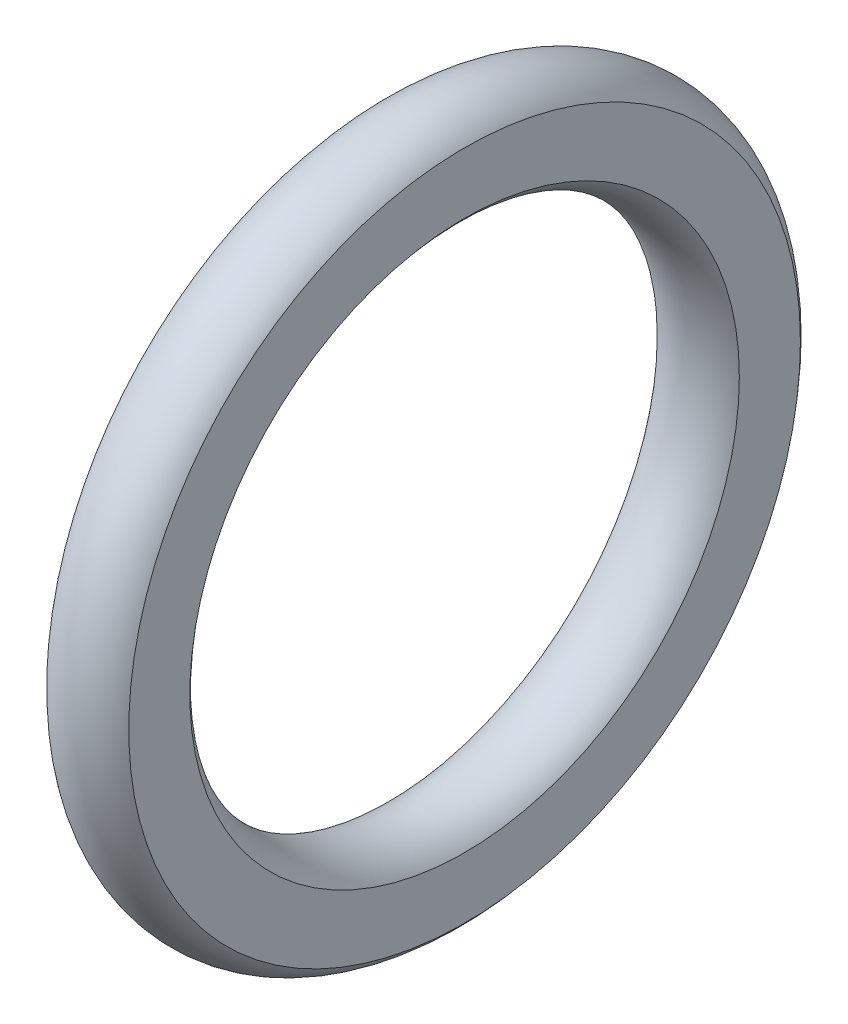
ISO-10303-21;
HEADER;
FILE_DESCRIPTION(('STEP AP214'),'2;1');
FILE_NAME('part.step','',(''),(''),'','','');
FILE_SCHEMA(('AUTOMOTIVE_DESIGN { 1 0 10303 214 1 1 1 1 }'));
ENDSEC;
DATA;
#1=APPLICATION_CONTEXT('core data for automotive mechanical design processes');
#2=APPLICATION_PROTOCOL_DEFINITION('international standard','automotive_design',2000,#1);
#3=PRODUCT_CONTEXT('',#1,'mechanical');
#4=PRODUCT('Part','Part','',(#3));
#5=PRODUCT_RELATED_PRODUCT_CATEGORY('part','',(#4));
#6=PRODUCT_DEFINITION_FORMATION('','',#4);
#7=PRODUCT_DEFINITION_CONTEXT('part definition',#1,'design');
#8=PRODUCT_DEFINITION('design','',#6,#7);
#9=PRODUCT_DEFINITION_SHAPE('','',#8);
#10=(LENGTH_UNIT() NAMED_UNIT(*) SI_UNIT(.MILLI.,.METRE.));
#11=(NAMED_UNIT(*) PLANE_ANGLE_UNIT() SI_UNIT($,.RADIAN.));
#12=(NAMED_UNIT(*) SI_UNIT($,.STERADIAN.) SOLID_ANGLE_UNIT());
#13=UNCERTAINTY_MEASURE_WITH_UNIT(LENGTH_MEASURE(1.E-05),#10,'distance_accuracy_value','');
#14=(GEOMETRIC_REPRESENTATION_CONTEXT(3) GLOBAL_UNCERTAINTY_ASSIGNED_CONTEXT((#13)) GLOBAL_UNIT_ASSIGNED_CONTEXT((#10,
#11,#12)) REPRESENTATION_CONTEXT('',''));
#15=CARTESIAN_POINT('',(0.,0.,0.));
#16=DIRECTION('',(0.,0.,1.));
#17=DIRECTION('',(1.,0.,0.));
#18=AXIS2_PLACEMENT_3D('',#15,#16,#17);
#19=CARTESIAN_POINT('',(1.19999999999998,4.5,0.));
#20=DIRECTION('',(1.,0.,0.));
#21=DIRECTION('',(0.,1.,0.));
#22=AXIS2_PLACEMENT_3D('',#19,#20,#21);
#23=PLANE('',#22);
#24=CARTESIAN_POINT('',(1.19999999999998,0.,0.));
#25=DIRECTION('',(1.,0.,0.));
#26=DIRECTION('',(0.,0.,-1.));
#27=AXIS2_PLACEMENT_3D('',#24,#25,#26);
#28=CIRCLE('',#27,4.95);
#29=CARTESIAN_POINT('',(1.19999999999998,0.,-4.95));
#30=VERTEX_POINT('',#29);
#31=EDGE_CURVE('E16',#30,#30,#28,.F.);
#32=ORIENTED_EDGE('',*,*,#31,.F.);
#33=EDGE_LOOP('',(#32));
#34=FACE_BOUND('',#33,.T.);
#35=CARTESIAN_POINT('',(1.19999999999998,0.,0.));
#36=DIRECTION('',(1.,0.,0.));
#37=DIRECTION('',(0.,0.,-1.));
#38=AXIS2_PLACEMENT_3D('',#35,#36,#37);
#39=CIRCLE('',#38,4.05);
#40=CARTESIAN_POINT('',(1.19999999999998,0.,-4.05));
#41=VERTEX_POINT('',#40);
#42=EDGE_CURVE('E29',#41,#41,#39,.T.);
#43=ORIENTED_EDGE('',*,*,#42,.F.);
#44=EDGE_LOOP('',(#43));
#45=FACE_BOUND('',#44,.T.);
#46=ADVANCED_FACE('F12',(#34,#45),#23,.T.);
#47=CARTESIAN_POINT('',(0.599999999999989,0.,0.));
#48=DIRECTION('',(1.,0.,0.));
#49=DIRECTION('',(0.,0.,-1.));
#50=AXIS2_PLACEMENT_3D('',#47,#48,#49);
#51=TOROIDAL_SURFACE('',#50,4.5,0.75);
#52=ORIENTED_EDGE('',*,*,#31,.T.);
#53=EDGE_LOOP('',(#52));
#54=FACE_BOUND('',#53,.T.);
#55=CARTESIAN_POINT('',(0.,0.,0.));
#56=DIRECTION('',(1.,0.,0.));
#57=DIRECTION('',(0.,0.,-1.));
#58=AXIS2_PLACEMENT_3D('',#55,#56,#57);
#59=CIRCLE('',#58,4.95);
#60=CARTESIAN_POINT('',(0.,0.,-4.95));
#61=VERTEX_POINT('',#60);
#62=EDGE_CURVE('E21',#61,#61,#59,.F.);
#63=ORIENTED_EDGE('',*,*,#62,.F.);
#64=EDGE_LOOP('',(#63));
#65=FACE_BOUND('',#64,.T.);
#66=ADVANCED_FACE('F41',(#54,#65),#51,.T.);
#67=CARTESIAN_POINT('',(0.599999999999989,0.,0.));
#68=DIRECTION('',(1.,0.,0.));
#69=DIRECTION('',(0.,0.,-1.));
#70=AXIS2_PLACEMENT_3D('',#67,#68,#69);
#71=TOROIDAL_SURFACE('',#70,4.5,0.75);
#72=ORIENTED_EDGE('',*,*,#42,.T.);
#73=EDGE_LOOP('',(#72));
#74=FACE_BOUND('',#73,.T.);
#75=CARTESIAN_POINT('',(0.,0.,0.));
#76=DIRECTION('',(1.,0.,0.));
#77=DIRECTION('',(0.,0.,-1.));
#78=AXIS2_PLACEMENT_3D('',#75,#76,#77);
#79=CIRCLE('',#78,4.05);
#80=CARTESIAN_POINT('',(0.,0.,-4.05));
#81=VERTEX_POINT('',#80);
#82=EDGE_CURVE('E8',#81,#81,#79,.T.);
#83=ORIENTED_EDGE('',*,*,#82,.F.);
#84=EDGE_LOOP('',(#83));
#85=FACE_BOUND('',#84,.T.);
#86=ADVANCED_FACE('F50',(#74,#85),#71,.T.);
#87=CARTESIAN_POINT('',(0.,4.5,0.));
#88=DIRECTION('',(-1.,0.,0.));
#89=DIRECTION('',(0.,-1.,0.));
#90=AXIS2_PLACEMENT_3D('',#87,#88,#89);
#91=PLANE('',#90);
#92=ORIENTED_EDGE('',*,*,#82,.T.);
#93=EDGE_LOOP('',(#92));
#94=FACE_BOUND('',#93,.T.);
#95=ORIENTED_EDGE('',*,*,#62,.T.);
#96=EDGE_LOOP('',(#95));
#97=FACE_BOUND('',#96,.T.);
#98=ADVANCED_FACE('F14',(#94,#97),#91,.T.);
#99=CLOSED_SHELL('',(#46,#66,#86,#98));
#100=MANIFOLD_SOLID_BREP('B1',#99);
#101=ADVANCED_BREP_SHAPE_REPRESENTATION('',(#18,#100),#14);
#102=SHAPE_DEFINITION_REPRESENTATION(#9,#101);
ENDSEC;
END-ISO-10303-21;
